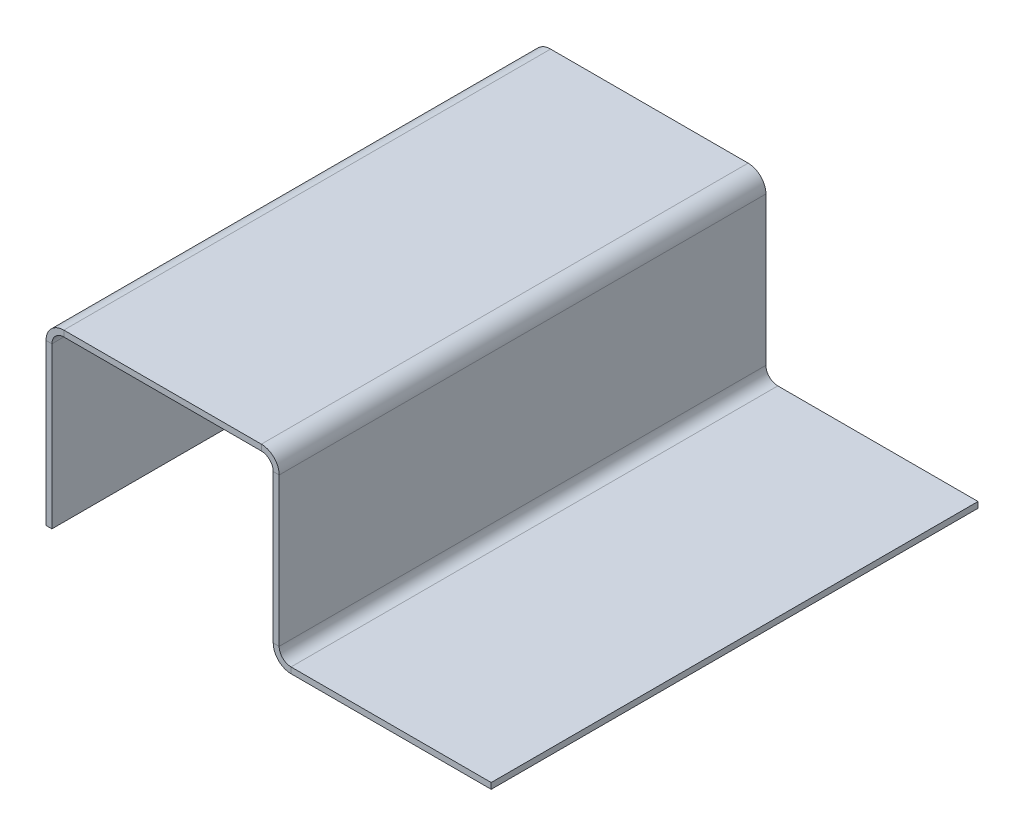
ISO-10303-21;
HEADER;
FILE_DESCRIPTION(('STEP AP214'),'2;1');
FILE_NAME('part.step','',(''),(''),'','','');
FILE_SCHEMA(('AUTOMOTIVE_DESIGN { 1 0 10303 214 1 1 1 1 }'));
ENDSEC;
DATA;
#1=APPLICATION_CONTEXT('core data for automotive mechanical design processes');
#2=APPLICATION_PROTOCOL_DEFINITION('international standard','automotive_design',2000,#1);
#3=PRODUCT_CONTEXT('',#1,'mechanical');
#4=PRODUCT('Part','Part','',(#3));
#5=PRODUCT_RELATED_PRODUCT_CATEGORY('part','',(#4));
#6=PRODUCT_DEFINITION_FORMATION('','',#4);
#7=PRODUCT_DEFINITION_CONTEXT('part definition',#1,'design');
#8=PRODUCT_DEFINITION('design','',#6,#7);
#9=PRODUCT_DEFINITION_SHAPE('','',#8);
#10=(LENGTH_UNIT() NAMED_UNIT(*) SI_UNIT(.MILLI.,.METRE.));
#11=(NAMED_UNIT(*) PLANE_ANGLE_UNIT() SI_UNIT($,.RADIAN.));
#12=(NAMED_UNIT(*) SI_UNIT($,.STERADIAN.) SOLID_ANGLE_UNIT());
#13=UNCERTAINTY_MEASURE_WITH_UNIT(LENGTH_MEASURE(1.E-05),#10,'distance_accuracy_value','');
#14=(GEOMETRIC_REPRESENTATION_CONTEXT(3) GLOBAL_UNCERTAINTY_ASSIGNED_CONTEXT((#13)) GLOBAL_UNIT_ASSIGNED_CONTEXT((#10,
#11,#12)) REPRESENTATION_CONTEXT('',''));
#15=CARTESIAN_POINT('',(0.,0.,0.));
#16=DIRECTION('',(0.,0.,1.));
#17=DIRECTION('',(1.,0.,0.));
#18=AXIS2_PLACEMENT_3D('',#15,#16,#17);
#19=CARTESIAN_POINT('',(172.661518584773,0.,41.));
#20=DIRECTION('',(0.,1.,0.));
#21=DIRECTION('',(-1.,0.,0.));
#22=AXIS2_PLACEMENT_3D('',#19,#20,#21);
#23=PLANE('',#22);
#24=DIRECTION('',(0.,0.,-1.));
#25=VECTOR('',#24,1.);
#26=CARTESIAN_POINT('',(0.,0.,41.));
#27=LINE('',#26,#25);
#28=CARTESIAN_POINT('',(0.,0.,41.));
#29=VERTEX_POINT('',#28);
#30=CARTESIAN_POINT('',(0.,0.,-41.));
#31=VERTEX_POINT('',#30);
#32=EDGE_CURVE('E67',#29,#31,#27,.T.);
#33=ORIENTED_EDGE('',*,*,#32,.T.);
#34=DIRECTION('',(-1.,0.,0.));
#35=VECTOR('',#34,1.);
#36=CARTESIAN_POINT('',(172.661518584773,0.,-41.));
#37=LINE('',#36,#35);
#38=CARTESIAN_POINT('',(1.,0.,-41.));
#39=VERTEX_POINT('',#38);
#40=EDGE_CURVE('E192',#39,#31,#37,.T.);
#41=ORIENTED_EDGE('',*,*,#40,.F.);
#42=DIRECTION('',(0.,0.,-1.));
#43=VECTOR('',#42,1.);
#44=CARTESIAN_POINT('',(1.,0.,41.));
#45=LINE('',#44,#43);
#46=CARTESIAN_POINT('',(0.999999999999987,0.,41.));
#47=VERTEX_POINT('',#46);
#48=EDGE_CURVE('E11',#47,#39,#45,.T.);
#49=ORIENTED_EDGE('',*,*,#48,.F.);
#50=DIRECTION('',(-1.,0.,0.));
#51=VECTOR('',#50,1.);
#52=CARTESIAN_POINT('',(172.661518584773,0.,41.));
#53=LINE('',#52,#51);
#54=EDGE_CURVE('E62',#47,#29,#53,.T.);
#55=ORIENTED_EDGE('',*,*,#54,.T.);
#56=EDGE_LOOP('',(#33,#41,#49,#55));
#57=FACE_BOUND('',#56,.T.);
#58=ADVANCED_FACE('F31',(#57),#23,.F.);
#59=CARTESIAN_POINT('',(172.661518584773,0.,41.));
#60=DIRECTION('',(0.,0.,1.));
#61=DIRECTION('',(0.,1.,0.));
#62=AXIS2_PLACEMENT_3D('',#59,#60,#61);
#63=PLANE('',#62);
#64=DIRECTION('',(-1.,0.,0.));
#65=VECTOR('',#64,1.);
#66=CARTESIAN_POINT('',(172.661518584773,27.,41.));
#67=LINE('',#66,#65);
#68=CARTESIAN_POINT('',(1.00000000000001,27.,41.));
#69=VERTEX_POINT('',#68);
#70=CARTESIAN_POINT('',(0.,27.,41.));
#71=VERTEX_POINT('',#70);
#72=EDGE_CURVE('E154',#69,#71,#67,.T.);
#73=ORIENTED_EDGE('',*,*,#72,.T.);
#74=DIRECTION('',(0.,1.,0.));
#75=VECTOR('',#74,1.);
#76=CARTESIAN_POINT('',(0.,0.,41.));
#77=LINE('',#76,#75);
#78=EDGE_CURVE('E173',#29,#71,#77,.T.);
#79=ORIENTED_EDGE('',*,*,#78,.F.);
#80=ORIENTED_EDGE('',*,*,#54,.F.);
#81=DIRECTION('',(0.,1.,0.));
#82=VECTOR('',#81,1.);
#83=CARTESIAN_POINT('',(1.,0.,41.));
#84=LINE('',#83,#82);
#85=EDGE_CURVE('E163',#47,#69,#84,.T.);
#86=ORIENTED_EDGE('',*,*,#85,.T.);
#87=EDGE_LOOP('',(#73,#79,#80,#86));
#88=FACE_BOUND('',#87,.T.);
#89=ADVANCED_FACE('F172',(#88),#63,.T.);
#90=CARTESIAN_POINT('',(0.,0.,41.));
#91=DIRECTION('',(-1.,0.,0.));
#92=DIRECTION('',(0.,0.,1.));
#93=AXIS2_PLACEMENT_3D('',#90,#91,#92);
#94=PLANE('',#93);
#95=DIRECTION('',(0.,1.,0.));
#96=VECTOR('',#95,1.);
#97=CARTESIAN_POINT('',(0.,0.,-41.));
#98=LINE('',#97,#96);
#99=CARTESIAN_POINT('',(0.,27.,-41.));
#100=VERTEX_POINT('',#99);
#101=EDGE_CURVE('E189',#31,#100,#98,.T.);
#102=ORIENTED_EDGE('',*,*,#101,.F.);
#103=ORIENTED_EDGE('',*,*,#32,.F.);
#104=ORIENTED_EDGE('',*,*,#78,.T.);
#105=DIRECTION('',(0.,0.,-1.));
#106=VECTOR('',#105,1.);
#107=CARTESIAN_POINT('',(0.,27.,41.));
#108=LINE('',#107,#106);
#109=EDGE_CURVE('E175',#71,#100,#108,.T.);
#110=ORIENTED_EDGE('',*,*,#109,.T.);
#111=EDGE_LOOP('',(#102,#103,#104,#110));
#112=FACE_BOUND('',#111,.T.);
#113=ADVANCED_FACE('F195',(#112),#94,.T.);
#114=CARTESIAN_POINT('',(172.661518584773,0.,-41.));
#115=DIRECTION('',(0.,0.,1.));
#116=DIRECTION('',(0.,1.,0.));
#117=AXIS2_PLACEMENT_3D('',#114,#115,#116);
#118=PLANE('',#117);
#119=ORIENTED_EDGE('',*,*,#101,.T.);
#120=DIRECTION('',(-1.,0.,0.));
#121=VECTOR('',#120,1.);
#122=CARTESIAN_POINT('',(172.661518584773,27.,-41.));
#123=LINE('',#122,#121);
#124=CARTESIAN_POINT('',(1.00000000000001,27.,-40.9999999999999));
#125=VERTEX_POINT('',#124);
#126=EDGE_CURVE('E171',#125,#100,#123,.T.);
#127=ORIENTED_EDGE('',*,*,#126,.F.);
#128=DIRECTION('',(0.,1.,0.));
#129=VECTOR('',#128,1.);
#130=CARTESIAN_POINT('',(1.,0.,-41.));
#131=LINE('',#130,#129);
#132=EDGE_CURVE('E41',#39,#125,#131,.T.);
#133=ORIENTED_EDGE('',*,*,#132,.F.);
#134=ORIENTED_EDGE('',*,*,#40,.T.);
#135=EDGE_LOOP('',(#119,#127,#133,#134));
#136=FACE_BOUND('',#135,.T.);
#137=ADVANCED_FACE('F191',(#136),#118,.F.);
#138=CARTESIAN_POINT('',(1.,0.,41.));
#139=DIRECTION('',(-1.,0.,0.));
#140=DIRECTION('',(0.,0.,1.));
#141=AXIS2_PLACEMENT_3D('',#138,#139,#140);
#142=PLANE('',#141);
#143=ORIENTED_EDGE('',*,*,#132,.T.);
#144=DIRECTION('',(0.,0.,-1.));
#145=VECTOR('',#144,1.);
#146=CARTESIAN_POINT('',(1.,27.,41.));
#147=LINE('',#146,#145);
#148=EDGE_CURVE('E35',#69,#125,#147,.T.);
#149=ORIENTED_EDGE('',*,*,#148,.F.);
#150=ORIENTED_EDGE('',*,*,#85,.F.);
#151=ORIENTED_EDGE('',*,*,#48,.T.);
#152=EDGE_LOOP('',(#143,#149,#150,#151));
#153=FACE_BOUND('',#152,.T.);
#154=ADVANCED_FACE('F33',(#153),#142,.F.);
#155=CARTESIAN_POINT('',(3.00000000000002,-146.989651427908,41.));
#156=DIRECTION('',(0.,0.,1.));
#157=DIRECTION('',(1.,0.,0.));
#158=AXIS2_PLACEMENT_3D('',#155,#156,#157);
#159=PLANE('',#158);
#160=DIRECTION('',(0.,1.,0.));
#161=VECTOR('',#160,1.);
#162=CARTESIAN_POINT('',(36.2766311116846,-146.989651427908,41.));
#163=LINE('',#162,#161);
#164=CARTESIAN_POINT('',(36.2766311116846,29.,41.));
#165=VERTEX_POINT('',#164);
#166=CARTESIAN_POINT('',(36.2766311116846,30.,41.));
#167=VERTEX_POINT('',#166);
#168=EDGE_CURVE('E211',#165,#167,#163,.T.);
#169=ORIENTED_EDGE('',*,*,#168,.T.);
#170=DIRECTION('',(1.,0.,0.));
#171=VECTOR('',#170,1.);
#172=CARTESIAN_POINT('',(2.99999999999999,30.,41.));
#173=LINE('',#172,#171);
#174=CARTESIAN_POINT('',(3.,30.,41.));
#175=VERTEX_POINT('',#174);
#176=EDGE_CURVE('E217',#175,#167,#173,.T.);
#177=ORIENTED_EDGE('',*,*,#176,.F.);
#178=DIRECTION('',(0.,1.,0.));
#179=VECTOR('',#178,1.);
#180=CARTESIAN_POINT('',(3.00000000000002,-146.989651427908,41.));
#181=LINE('',#180,#179);
#182=CARTESIAN_POINT('',(3.,29.,41.));
#183=VERTEX_POINT('',#182);
#184=EDGE_CURVE('E209',#183,#175,#181,.T.);
#185=ORIENTED_EDGE('',*,*,#184,.F.);
#186=DIRECTION('',(1.,0.,0.));
#187=VECTOR('',#186,1.);
#188=CARTESIAN_POINT('',(2.99999999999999,29.,41.));
#189=LINE('',#188,#187);
#190=EDGE_CURVE('E214',#183,#165,#189,.T.);
#191=ORIENTED_EDGE('',*,*,#190,.T.);
#192=EDGE_LOOP('',(#169,#177,#185,#191));
#193=FACE_BOUND('',#192,.T.);
#194=ADVANCED_FACE('F331',(#193),#159,.T.);
#195=CARTESIAN_POINT('',(2.99999999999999,30.,41.));
#196=DIRECTION('',(0.,1.,0.));
#197=DIRECTION('',(-1.,0.,0.));
#198=AXIS2_PLACEMENT_3D('',#195,#196,#197);
#199=PLANE('',#198);
#200=DIRECTION('',(1.,0.,0.));
#201=VECTOR('',#200,1.);
#202=CARTESIAN_POINT('',(2.99999999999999,30.,-41.));
#203=LINE('',#202,#201);
#204=CARTESIAN_POINT('',(2.99999999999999,30.,-41.));
#205=VERTEX_POINT('',#204);
#206=CARTESIAN_POINT('',(36.2766311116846,30.,-41.));
#207=VERTEX_POINT('',#206);
#208=EDGE_CURVE('E223',#205,#207,#203,.T.);
#209=ORIENTED_EDGE('',*,*,#208,.F.);
#210=DIRECTION('',(0.,0.,-1.));
#211=VECTOR('',#210,1.);
#212=CARTESIAN_POINT('',(2.99999999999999,30.,41.));
#213=LINE('',#212,#211);
#214=EDGE_CURVE('E207',#175,#205,#213,.T.);
#215=ORIENTED_EDGE('',*,*,#214,.F.);
#216=ORIENTED_EDGE('',*,*,#176,.T.);
#217=DIRECTION('',(0.,0.,-1.));
#218=VECTOR('',#217,1.);
#219=CARTESIAN_POINT('',(36.2766311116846,30.,41.));
#220=LINE('',#219,#218);
#221=EDGE_CURVE('E220',#167,#207,#220,.T.);
#222=ORIENTED_EDGE('',*,*,#221,.T.);
#223=EDGE_LOOP('',(#209,#215,#216,#222));
#224=FACE_BOUND('',#223,.T.);
#225=ADVANCED_FACE('F328',(#224),#199,.T.);
#226=CARTESIAN_POINT('',(3.00000000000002,-146.989651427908,-41.));
#227=DIRECTION('',(0.,0.,1.));
#228=DIRECTION('',(1.,0.,0.));
#229=AXIS2_PLACEMENT_3D('',#226,#227,#228);
#230=PLANE('',#229);
#231=ORIENTED_EDGE('',*,*,#208,.T.);
#232=DIRECTION('',(0.,1.,0.));
#233=VECTOR('',#232,1.);
#234=CARTESIAN_POINT('',(36.2766311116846,-146.989651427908,-41.));
#235=LINE('',#234,#233);
#236=CARTESIAN_POINT('',(36.2766311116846,29.,-40.9999999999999));
#237=VERTEX_POINT('',#236);
#238=EDGE_CURVE('E203',#237,#207,#235,.T.);
#239=ORIENTED_EDGE('',*,*,#238,.F.);
#240=DIRECTION('',(1.,0.,0.));
#241=VECTOR('',#240,1.);
#242=CARTESIAN_POINT('',(2.99999999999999,29.,-41.));
#243=LINE('',#242,#241);
#244=CARTESIAN_POINT('',(2.99999999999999,29.,-41.));
#245=VERTEX_POINT('',#244);
#246=EDGE_CURVE('E229',#245,#237,#243,.T.);
#247=ORIENTED_EDGE('',*,*,#246,.F.);
#248=DIRECTION('',(0.,1.,0.));
#249=VECTOR('',#248,1.);
#250=CARTESIAN_POINT('',(3.00000000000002,-146.989651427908,-41.));
#251=LINE('',#250,#249);
#252=EDGE_CURVE('E226',#245,#205,#251,.T.);
#253=ORIENTED_EDGE('',*,*,#252,.T.);
#254=EDGE_LOOP('',(#231,#239,#247,#253));
#255=FACE_BOUND('',#254,.T.);
#256=ADVANCED_FACE('F345',(#255),#230,.F.);
#257=CARTESIAN_POINT('',(2.99999999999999,29.,41.));
#258=DIRECTION('',(0.,1.,0.));
#259=DIRECTION('',(-1.,0.,0.));
#260=AXIS2_PLACEMENT_3D('',#257,#258,#259);
#261=PLANE('',#260);
#262=ORIENTED_EDGE('',*,*,#246,.T.);
#263=DIRECTION('',(0.,0.,-1.));
#264=VECTOR('',#263,1.);
#265=CARTESIAN_POINT('',(36.2766311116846,29.,41.));
#266=LINE('',#265,#264);
#267=EDGE_CURVE('E200',#165,#237,#266,.T.);
#268=ORIENTED_EDGE('',*,*,#267,.F.);
#269=ORIENTED_EDGE('',*,*,#190,.F.);
#270=DIRECTION('',(0.,0.,-1.));
#271=VECTOR('',#270,1.);
#272=CARTESIAN_POINT('',(2.99999999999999,29.,41.));
#273=LINE('',#272,#271);
#274=EDGE_CURVE('E168',#183,#245,#273,.T.);
#275=ORIENTED_EDGE('',*,*,#274,.T.);
#276=EDGE_LOOP('',(#262,#268,#269,#275));
#277=FACE_BOUND('',#276,.T.);
#278=ADVANCED_FACE('F342',(#277),#261,.F.);
#279=CARTESIAN_POINT('',(38.2766311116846,27.,41.));
#280=DIRECTION('',(1.,0.,0.));
#281=DIRECTION('',(0.,1.,0.));
#282=AXIS2_PLACEMENT_3D('',#279,#280,#281);
#283=PLANE('',#282);
#284=DIRECTION('',(0.,-1.,0.));
#285=VECTOR('',#284,1.);
#286=CARTESIAN_POINT('',(38.2766311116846,27.,-41.));
#287=LINE('',#286,#285);
#288=CARTESIAN_POINT('',(38.2766311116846,27.,-40.9999999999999));
#289=VERTEX_POINT('',#288);
#290=CARTESIAN_POINT('',(38.2766311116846,1.99999999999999,-41.));
#291=VERTEX_POINT('',#290);
#292=EDGE_CURVE('E261',#289,#291,#287,.T.);
#293=ORIENTED_EDGE('',*,*,#292,.T.);
#294=DIRECTION('',(0.,0.,-1.));
#295=VECTOR('',#294,1.);
#296=CARTESIAN_POINT('',(38.2766311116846,1.99999999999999,41.));
#297=LINE('',#296,#295);
#298=CARTESIAN_POINT('',(38.2766311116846,1.99999999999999,41.));
#299=VERTEX_POINT('',#298);
#300=EDGE_CURVE('E258',#299,#291,#297,.T.);
#301=ORIENTED_EDGE('',*,*,#300,.F.);
#302=DIRECTION('',(0.,-1.,0.));
#303=VECTOR('',#302,1.);
#304=CARTESIAN_POINT('',(38.2766311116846,27.,41.));
#305=LINE('',#304,#303);
#306=CARTESIAN_POINT('',(38.2766311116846,27.,41.));
#307=VERTEX_POINT('',#306);
#308=EDGE_CURVE('E255',#307,#299,#305,.T.);
#309=ORIENTED_EDGE('',*,*,#308,.F.);
#310=DIRECTION('',(0.,0.,-1.));
#311=VECTOR('',#310,1.);
#312=CARTESIAN_POINT('',(38.2766311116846,27.,41.));
#313=LINE('',#312,#311);
#314=EDGE_CURVE('E252',#307,#289,#313,.T.);
#315=ORIENTED_EDGE('',*,*,#314,.T.);
#316=EDGE_LOOP('',(#293,#301,#309,#315));
#317=FACE_BOUND('',#316,.T.);
#318=ADVANCED_FACE('F355',(#317),#283,.F.);
#319=CARTESIAN_POINT('',(210.729248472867,26.9999999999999,-41.));
#320=DIRECTION('',(0.,0.,-1.));
#321=DIRECTION('',(0.,1.,0.));
#322=AXIS2_PLACEMENT_3D('',#319,#320,#321);
#323=PLANE('',#322);
#324=ORIENTED_EDGE('',*,*,#292,.F.);
#325=DIRECTION('',(-1.,0.,0.));
#326=VECTOR('',#325,1.);
#327=CARTESIAN_POINT('',(210.729248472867,26.9999999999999,-41.));
#328=LINE('',#327,#326);
#329=CARTESIAN_POINT('',(39.2766311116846,27.,-41.));
#330=VERTEX_POINT('',#329);
#331=EDGE_CURVE('E204',#330,#289,#328,.T.);
#332=ORIENTED_EDGE('',*,*,#331,.F.);
#333=DIRECTION('',(0.,-1.,0.));
#334=VECTOR('',#333,1.);
#335=CARTESIAN_POINT('',(39.2766311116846,27.,-41.));
#336=LINE('',#335,#334);
#337=CARTESIAN_POINT('',(39.2766311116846,1.99999999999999,-41.));
#338=VERTEX_POINT('',#337);
#339=EDGE_CURVE('E250',#330,#338,#336,.T.);
#340=ORIENTED_EDGE('',*,*,#339,.T.);
#341=DIRECTION('',(-1.,0.,0.));
#342=VECTOR('',#341,1.);
#343=CARTESIAN_POINT('',(210.729248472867,1.99999999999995,-41.));
#344=LINE('',#343,#342);
#345=EDGE_CURVE('E240',#338,#291,#344,.T.);
#346=ORIENTED_EDGE('',*,*,#345,.T.);
#347=EDGE_LOOP('',(#324,#332,#340,#346));
#348=FACE_BOUND('',#347,.T.);
#349=ADVANCED_FACE('F351',(#348),#323,.T.);
#350=CARTESIAN_POINT('',(210.729248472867,26.9999999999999,41.));
#351=DIRECTION('',(0.,0.,-1.));
#352=DIRECTION('',(0.,1.,0.));
#353=AXIS2_PLACEMENT_3D('',#350,#351,#352);
#354=PLANE('',#353);
#355=DIRECTION('',(-1.,0.,0.));
#356=VECTOR('',#355,1.);
#357=CARTESIAN_POINT('',(210.729248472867,26.9999999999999,41.));
#358=LINE('',#357,#356);
#359=CARTESIAN_POINT('',(39.2766311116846,27.,41.));
#360=VERTEX_POINT('',#359);
#361=EDGE_CURVE('E234',#360,#307,#358,.T.);
#362=ORIENTED_EDGE('',*,*,#361,.T.);
#363=ORIENTED_EDGE('',*,*,#308,.T.);
#364=DIRECTION('',(-1.,0.,0.));
#365=VECTOR('',#364,1.);
#366=CARTESIAN_POINT('',(210.729248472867,1.99999999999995,41.));
#367=LINE('',#366,#365);
#368=CARTESIAN_POINT('',(39.2766311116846,1.99999999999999,41.));
#369=VERTEX_POINT('',#368);
#370=EDGE_CURVE('E237',#369,#299,#367,.T.);
#371=ORIENTED_EDGE('',*,*,#370,.F.);
#372=DIRECTION('',(0.,-1.,0.));
#373=VECTOR('',#372,1.);
#374=CARTESIAN_POINT('',(39.2766311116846,27.,41.));
#375=LINE('',#374,#373);
#376=EDGE_CURVE('E245',#360,#369,#375,.T.);
#377=ORIENTED_EDGE('',*,*,#376,.F.);
#378=EDGE_LOOP('',(#362,#363,#371,#377));
#379=FACE_BOUND('',#378,.T.);
#380=ADVANCED_FACE('F358',(#379),#354,.F.);
#381=CARTESIAN_POINT('',(39.2766311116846,27.,41.));
#382=DIRECTION('',(1.,0.,0.));
#383=DIRECTION('',(0.,1.,0.));
#384=AXIS2_PLACEMENT_3D('',#381,#382,#383);
#385=PLANE('',#384);
#386=ORIENTED_EDGE('',*,*,#339,.F.);
#387=DIRECTION('',(0.,0.,-1.));
#388=VECTOR('',#387,1.);
#389=CARTESIAN_POINT('',(39.2766311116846,27.,41.));
#390=LINE('',#389,#388);
#391=EDGE_CURVE('E248',#360,#330,#390,.T.);
#392=ORIENTED_EDGE('',*,*,#391,.F.);
#393=ORIENTED_EDGE('',*,*,#376,.T.);
#394=DIRECTION('',(0.,0.,-1.));
#395=VECTOR('',#394,1.);
#396=CARTESIAN_POINT('',(39.2766311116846,1.99999999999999,41.));
#397=LINE('',#396,#395);
#398=EDGE_CURVE('E242',#369,#338,#397,.T.);
#399=ORIENTED_EDGE('',*,*,#398,.T.);
#400=EDGE_LOOP('',(#386,#392,#393,#399));
#401=FACE_BOUND('',#400,.T.);
#402=ADVANCED_FACE('F363',(#401),#385,.T.);
#403=CARTESIAN_POINT('',(75.,177.327556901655,41.));
#404=DIRECTION('',(-1.,0.,0.));
#405=DIRECTION('',(0.,0.,1.));
#406=AXIS2_PLACEMENT_3D('',#403,#404,#405);
#407=PLANE('',#406);
#408=DIRECTION('',(0.,-1.,0.));
#409=VECTOR('',#408,1.);
#410=CARTESIAN_POINT('',(75.,177.327556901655,41.));
#411=LINE('',#410,#409);
#412=CARTESIAN_POINT('',(75.,0.,41.));
#413=VERTEX_POINT('',#412);
#414=CARTESIAN_POINT('',(75.,-1.,41.));
#415=VERTEX_POINT('',#414);
#416=EDGE_CURVE('E271',#413,#415,#411,.T.);
#417=ORIENTED_EDGE('',*,*,#416,.T.);
#418=DIRECTION('',(0.,0.,-1.));
#419=VECTOR('',#418,1.);
#420=CARTESIAN_POINT('',(75.,-1.,41.));
#421=LINE('',#420,#419);
#422=CARTESIAN_POINT('',(75.,-1.,-41.));
#423=VERTEX_POINT('',#422);
#424=EDGE_CURVE('E274',#415,#423,#421,.T.);
#425=ORIENTED_EDGE('',*,*,#424,.T.);
#426=DIRECTION('',(0.,-1.,0.));
#427=VECTOR('',#426,1.);
#428=CARTESIAN_POINT('',(75.,177.327556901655,-41.));
#429=LINE('',#428,#427);
#430=CARTESIAN_POINT('',(75.,0.,-41.));
#431=VERTEX_POINT('',#430);
#432=EDGE_CURVE('E264',#431,#423,#429,.T.);
#433=ORIENTED_EDGE('',*,*,#432,.F.);
#434=DIRECTION('',(0.,0.,-1.));
#435=VECTOR('',#434,1.);
#436=CARTESIAN_POINT('',(75.,0.,41.));
#437=LINE('',#436,#435);
#438=EDGE_CURVE('E280',#413,#431,#437,.T.);
#439=ORIENTED_EDGE('',*,*,#438,.F.);
#440=EDGE_LOOP('',(#417,#425,#433,#439));
#441=FACE_BOUND('',#440,.T.);
#442=ADVANCED_FACE('F383',(#441),#407,.F.);
#443=CARTESIAN_POINT('',(41.2766311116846,0.,41.));
#444=DIRECTION('',(0.,1.,0.));
#445=DIRECTION('',(0.,0.,1.));
#446=AXIS2_PLACEMENT_3D('',#443,#444,#445);
#447=PLANE('',#446);
#448=DIRECTION('',(1.,0.,0.));
#449=VECTOR('',#448,1.);
#450=CARTESIAN_POINT('',(41.2766311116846,0.,-41.));
#451=LINE('',#450,#449);
#452=CARTESIAN_POINT('',(41.2766311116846,0.,-41.));
#453=VERTEX_POINT('',#452);
#454=EDGE_CURVE('E294',#453,#431,#451,.T.);
#455=ORIENTED_EDGE('',*,*,#454,.F.);
#456=DIRECTION('',(0.,0.,-1.));
#457=VECTOR('',#456,1.);
#458=CARTESIAN_POINT('',(41.2766311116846,0.,41.));
#459=LINE('',#458,#457);
#460=CARTESIAN_POINT('',(41.2766311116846,0.,40.9999999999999));
#461=VERTEX_POINT('',#460);
#462=EDGE_CURVE('E265',#461,#453,#459,.T.);
#463=ORIENTED_EDGE('',*,*,#462,.F.);
#464=DIRECTION('',(1.,0.,0.));
#465=VECTOR('',#464,1.);
#466=CARTESIAN_POINT('',(41.2766311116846,0.,41.));
#467=LINE('',#466,#465);
#468=EDGE_CURVE('E277',#461,#413,#467,.T.);
#469=ORIENTED_EDGE('',*,*,#468,.T.);
#470=ORIENTED_EDGE('',*,*,#438,.T.);
#471=EDGE_LOOP('',(#455,#463,#469,#470));
#472=FACE_BOUND('',#471,.T.);
#473=ADVANCED_FACE('F380',(#472),#447,.T.);
#474=CARTESIAN_POINT('',(41.2766311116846,177.327556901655,41.));
#475=DIRECTION('',(0.,0.,-1.));
#476=DIRECTION('',(-1.,0.,0.));
#477=AXIS2_PLACEMENT_3D('',#474,#475,#476);
#478=PLANE('',#477);
#479=DIRECTION('',(0.,-1.,0.));
#480=VECTOR('',#479,1.);
#481=CARTESIAN_POINT('',(41.2766311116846,177.327556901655,41.));
#482=LINE('',#481,#480);
#483=CARTESIAN_POINT('',(41.2766311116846,-1.,41.));
#484=VERTEX_POINT('',#483);
#485=EDGE_CURVE('E283',#461,#484,#482,.T.);
#486=ORIENTED_EDGE('',*,*,#485,.T.);
#487=DIRECTION('',(1.,0.,0.));
#488=VECTOR('',#487,1.);
#489=CARTESIAN_POINT('',(41.2766311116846,-1.,41.));
#490=LINE('',#489,#488);
#491=EDGE_CURVE('E286',#484,#415,#490,.T.);
#492=ORIENTED_EDGE('',*,*,#491,.T.);
#493=ORIENTED_EDGE('',*,*,#416,.F.);
#494=ORIENTED_EDGE('',*,*,#468,.F.);
#495=EDGE_LOOP('',(#486,#492,#493,#494));
#496=FACE_BOUND('',#495,.T.);
#497=ADVANCED_FACE('F385',(#496),#478,.F.);
#498=CARTESIAN_POINT('',(41.2766311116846,-1.,41.));
#499=DIRECTION('',(0.,1.,0.));
#500=DIRECTION('',(0.,0.,1.));
#501=AXIS2_PLACEMENT_3D('',#498,#499,#500);
#502=PLANE('',#501);
#503=DIRECTION('',(1.,0.,0.));
#504=VECTOR('',#503,1.);
#505=CARTESIAN_POINT('',(41.2766311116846,-1.,-41.));
#506=LINE('',#505,#504);
#507=CARTESIAN_POINT('',(41.2766311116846,-1.,-41.));
#508=VERTEX_POINT('',#507);
#509=EDGE_CURVE('E289',#508,#423,#506,.T.);
#510=ORIENTED_EDGE('',*,*,#509,.T.);
#511=ORIENTED_EDGE('',*,*,#424,.F.);
#512=ORIENTED_EDGE('',*,*,#491,.F.);
#513=DIRECTION('',(0.,0.,-1.));
#514=VECTOR('',#513,1.);
#515=CARTESIAN_POINT('',(41.2766311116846,-1.,41.));
#516=LINE('',#515,#514);
#517=EDGE_CURVE('E291',#484,#508,#516,.T.);
#518=ORIENTED_EDGE('',*,*,#517,.T.);
#519=EDGE_LOOP('',(#510,#511,#512,#518));
#520=FACE_BOUND('',#519,.T.);
#521=ADVANCED_FACE('F388',(#520),#502,.F.);
#522=CARTESIAN_POINT('',(41.2766311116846,177.327556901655,-41.));
#523=DIRECTION('',(0.,0.,-1.));
#524=DIRECTION('',(-1.,0.,0.));
#525=AXIS2_PLACEMENT_3D('',#522,#523,#524);
#526=PLANE('',#525);
#527=ORIENTED_EDGE('',*,*,#509,.F.);
#528=DIRECTION('',(0.,-1.,0.));
#529=VECTOR('',#528,1.);
#530=CARTESIAN_POINT('',(41.2766311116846,177.327556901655,-41.));
#531=LINE('',#530,#529);
#532=EDGE_CURVE('E268',#453,#508,#531,.T.);
#533=ORIENTED_EDGE('',*,*,#532,.F.);
#534=ORIENTED_EDGE('',*,*,#454,.T.);
#535=ORIENTED_EDGE('',*,*,#432,.T.);
#536=EDGE_LOOP('',(#527,#533,#534,#535));
#537=FACE_BOUND('',#536,.T.);
#538=ADVANCED_FACE('F379',(#537),#526,.T.);
#539=CARTESIAN_POINT('',(41.2766311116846,2.,-41.));
#540=DIRECTION('',(0.,0.,-1.));
#541=DIRECTION('',(-1.,0.,0.));
#542=AXIS2_PLACEMENT_3D('',#539,#540,#541);
#543=PLANE('',#542);
#544=ORIENTED_EDGE('',*,*,#345,.F.);
#545=CARTESIAN_POINT('',(41.2766311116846,2.,-41.));
#546=DIRECTION('',(0.,0.,1.));
#547=DIRECTION('',(1.,0.,0.));
#548=AXIS2_PLACEMENT_3D('',#545,#546,#547);
#549=CIRCLE('',#548,2.);
#550=EDGE_CURVE('E307',#338,#453,#549,.T.);
#551=ORIENTED_EDGE('',*,*,#550,.T.);
#552=ORIENTED_EDGE('',*,*,#532,.T.);
#553=CARTESIAN_POINT('',(41.2766311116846,2.,-41.));
#554=DIRECTION('',(0.,0.,1.));
#555=DIRECTION('',(1.,0.,0.));
#556=AXIS2_PLACEMENT_3D('',#553,#554,#555);
#557=CIRCLE('',#556,3.);
#558=EDGE_CURVE('E301',#291,#508,#557,.T.);
#559=ORIENTED_EDGE('',*,*,#558,.F.);
#560=EDGE_LOOP('',(#544,#551,#552,#559));
#561=FACE_BOUND('',#560,.T.);
#562=ADVANCED_FACE('F370',(#561),#543,.T.);
#563=CARTESIAN_POINT('',(41.2766311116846,2.,41.));
#564=DIRECTION('',(0.,0.,1.));
#565=DIRECTION('',(1.,0.,0.));
#566=AXIS2_PLACEMENT_3D('',#563,#564,#565);
#567=PLANE('',#566);
#568=CARTESIAN_POINT('',(41.2766311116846,2.,40.9999999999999));
#569=DIRECTION('',(0.,0.,1.));
#570=DIRECTION('',(1.,0.,0.));
#571=AXIS2_PLACEMENT_3D('',#568,#569,#570);
#572=CIRCLE('',#571,2.);
#573=EDGE_CURVE('E304',#461,#369,#572,.F.);
#574=ORIENTED_EDGE('',*,*,#573,.T.);
#575=ORIENTED_EDGE('',*,*,#370,.T.);
#576=CARTESIAN_POINT('',(41.2766311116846,2.,41.));
#577=DIRECTION('',(0.,0.,-1.));
#578=DIRECTION('',(-1.,0.,0.));
#579=AXIS2_PLACEMENT_3D('',#576,#577,#578);
#580=CIRCLE('',#579,3.);
#581=EDGE_CURVE('E269',#484,#299,#580,.T.);
#582=ORIENTED_EDGE('',*,*,#581,.F.);
#583=ORIENTED_EDGE('',*,*,#485,.F.);
#584=EDGE_LOOP('',(#574,#575,#582,#583));
#585=FACE_BOUND('',#584,.T.);
#586=ADVANCED_FACE('F393',(#585),#567,.T.);
#587=CARTESIAN_POINT('',(41.2766311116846,2.,-197.366573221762));
#588=DIRECTION('',(0.,0.,1.));
#589=DIRECTION('',(1.,0.,0.));
#590=AXIS2_PLACEMENT_3D('',#587,#588,#589);
#591=CYLINDRICAL_SURFACE('',#590,3.);
#592=ORIENTED_EDGE('',*,*,#517,.F.);
#593=ORIENTED_EDGE('',*,*,#581,.T.);
#594=ORIENTED_EDGE('',*,*,#300,.T.);
#595=ORIENTED_EDGE('',*,*,#558,.T.);
#596=EDGE_LOOP('',(#592,#593,#594,#595));
#597=FACE_BOUND('',#596,.T.);
#598=ADVANCED_FACE('F391',(#597),#591,.T.);
#599=CARTESIAN_POINT('',(41.2766311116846,2.,-197.366573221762));
#600=DIRECTION('',(0.,0.,1.));
#601=DIRECTION('',(1.,0.,0.));
#602=AXIS2_PLACEMENT_3D('',#599,#600,#601);
#603=CYLINDRICAL_SURFACE('',#602,2.);
#604=ORIENTED_EDGE('',*,*,#462,.T.);
#605=ORIENTED_EDGE('',*,*,#550,.F.);
#606=ORIENTED_EDGE('',*,*,#398,.F.);
#607=ORIENTED_EDGE('',*,*,#573,.F.);
#608=EDGE_LOOP('',(#604,#605,#606,#607));
#609=FACE_BOUND('',#608,.T.);
#610=ADVANCED_FACE('F371',(#609),#603,.F.);
#611=CARTESIAN_POINT('',(36.2766311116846,27.,-41.));
#612=DIRECTION('',(0.,0.,1.));
#613=DIRECTION('',(1.,0.,0.));
#614=AXIS2_PLACEMENT_3D('',#611,#612,#613);
#615=PLANE('',#614);
#616=ORIENTED_EDGE('',*,*,#331,.T.);
#617=CARTESIAN_POINT('',(36.2766311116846,27.,-40.9999999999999));
#618=DIRECTION('',(0.,0.,-1.));
#619=DIRECTION('',(-1.,0.,0.));
#620=AXIS2_PLACEMENT_3D('',#617,#618,#619);
#621=CIRCLE('',#620,2.00000000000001);
#622=EDGE_CURVE('E318',#237,#289,#621,.T.);
#623=ORIENTED_EDGE('',*,*,#622,.F.);
#624=ORIENTED_EDGE('',*,*,#238,.T.);
#625=CARTESIAN_POINT('',(36.2766311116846,27.,-41.));
#626=DIRECTION('',(0.,0.,-1.));
#627=DIRECTION('',(-1.,0.,0.));
#628=AXIS2_PLACEMENT_3D('',#625,#626,#627);
#629=CIRCLE('',#628,3.);
#630=EDGE_CURVE('E312',#207,#330,#629,.T.);
#631=ORIENTED_EDGE('',*,*,#630,.T.);
#632=EDGE_LOOP('',(#616,#623,#624,#631));
#633=FACE_BOUND('',#632,.T.);
#634=ADVANCED_FACE('F347',(#633),#615,.F.);
#635=CARTESIAN_POINT('',(36.2766311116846,27.,41.));
#636=DIRECTION('',(0.,0.,-1.));
#637=DIRECTION('',(-1.,0.,0.));
#638=AXIS2_PLACEMENT_3D('',#635,#636,#637);
#639=PLANE('',#638);
#640=CARTESIAN_POINT('',(36.2766311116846,27.,41.));
#641=DIRECTION('',(0.,0.,-1.));
#642=DIRECTION('',(-1.,0.,0.));
#643=AXIS2_PLACEMENT_3D('',#640,#641,#642);
#644=CIRCLE('',#643,2.00000000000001);
#645=EDGE_CURVE('E315',#307,#165,#644,.F.);
#646=ORIENTED_EDGE('',*,*,#645,.F.);
#647=ORIENTED_EDGE('',*,*,#361,.F.);
#648=CARTESIAN_POINT('',(36.2766311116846,27.,41.));
#649=DIRECTION('',(0.,0.,1.));
#650=DIRECTION('',(1.,0.,0.));
#651=AXIS2_PLACEMENT_3D('',#648,#649,#650);
#652=CIRCLE('',#651,3.);
#653=EDGE_CURVE('E309',#360,#167,#652,.T.);
#654=ORIENTED_EDGE('',*,*,#653,.T.);
#655=ORIENTED_EDGE('',*,*,#168,.F.);
#656=EDGE_LOOP('',(#646,#647,#654,#655));
#657=FACE_BOUND('',#656,.T.);
#658=ADVANCED_FACE('F333',(#657),#639,.F.);
#659=CARTESIAN_POINT('',(36.2766311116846,27.,173.73345907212));
#660=DIRECTION('',(0.,0.,-1.));
#661=DIRECTION('',(-1.,0.,0.));
#662=AXIS2_PLACEMENT_3D('',#659,#660,#661);
#663=CYLINDRICAL_SURFACE('',#662,3.00000000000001);
#664=ORIENTED_EDGE('',*,*,#221,.F.);
#665=ORIENTED_EDGE('',*,*,#653,.F.);
#666=ORIENTED_EDGE('',*,*,#391,.T.);
#667=ORIENTED_EDGE('',*,*,#630,.F.);
#668=EDGE_LOOP('',(#664,#665,#666,#667));
#669=FACE_BOUND('',#668,.T.);
#670=ADVANCED_FACE('F361',(#669),#663,.T.);
#671=CARTESIAN_POINT('',(36.2766311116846,27.,173.73345907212));
#672=DIRECTION('',(0.,0.,-1.));
#673=DIRECTION('',(-1.,0.,0.));
#674=AXIS2_PLACEMENT_3D('',#671,#672,#673);
#675=CYLINDRICAL_SURFACE('',#674,2.00000000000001);
#676=ORIENTED_EDGE('',*,*,#267,.T.);
#677=ORIENTED_EDGE('',*,*,#622,.T.);
#678=ORIENTED_EDGE('',*,*,#314,.F.);
#679=ORIENTED_EDGE('',*,*,#645,.T.);
#680=EDGE_LOOP('',(#676,#677,#678,#679));
#681=FACE_BOUND('',#680,.T.);
#682=ADVANCED_FACE('F338',(#681),#675,.F.);
#683=CARTESIAN_POINT('',(3.,27.,-41.));
#684=DIRECTION('',(0.,0.,-1.));
#685=DIRECTION('',(-1.,0.,0.));
#686=AXIS2_PLACEMENT_3D('',#683,#684,#685);
#687=PLANE('',#686);
#688=ORIENTED_EDGE('',*,*,#252,.F.);
#689=CARTESIAN_POINT('',(3.,27.,-40.9999999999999));
#690=DIRECTION('',(0.,0.,-1.));
#691=DIRECTION('',(-1.,0.,0.));
#692=AXIS2_PLACEMENT_3D('',#689,#690,#691);
#693=CIRCLE('',#692,2.);
#694=EDGE_CURVE('E74',#245,#125,#693,.F.);
#695=ORIENTED_EDGE('',*,*,#694,.T.);
#696=ORIENTED_EDGE('',*,*,#126,.T.);
#697=CARTESIAN_POINT('',(3.,27.,-41.));
#698=DIRECTION('',(0.,0.,1.));
#699=DIRECTION('',(1.,0.,0.));
#700=AXIS2_PLACEMENT_3D('',#697,#698,#699);
#701=CIRCLE('',#700,3.);
#702=EDGE_CURVE('E185',#205,#100,#701,.T.);
#703=ORIENTED_EDGE('',*,*,#702,.F.);
#704=EDGE_LOOP('',(#688,#695,#696,#703));
#705=FACE_BOUND('',#704,.T.);
#706=ADVANCED_FACE('F184',(#705),#687,.T.);
#707=CARTESIAN_POINT('',(3.,27.,41.));
#708=DIRECTION('',(0.,0.,1.));
#709=DIRECTION('',(1.,0.,0.));
#710=AXIS2_PLACEMENT_3D('',#707,#708,#709);
#711=PLANE('',#710);
#712=ORIENTED_EDGE('',*,*,#72,.F.);
#713=CARTESIAN_POINT('',(3.,27.,41.));
#714=DIRECTION('',(0.,0.,-1.));
#715=DIRECTION('',(-1.,0.,0.));
#716=AXIS2_PLACEMENT_3D('',#713,#714,#715);
#717=CIRCLE('',#716,2.);
#718=EDGE_CURVE('E157',#69,#183,#717,.T.);
#719=ORIENTED_EDGE('',*,*,#718,.T.);
#720=ORIENTED_EDGE('',*,*,#184,.T.);
#721=CARTESIAN_POINT('',(3.,27.,41.));
#722=DIRECTION('',(0.,0.,-1.));
#723=DIRECTION('',(-1.,0.,0.));
#724=AXIS2_PLACEMENT_3D('',#721,#722,#723);
#725=CIRCLE('',#724,3.);
#726=EDGE_CURVE('E159',#71,#175,#725,.T.);
#727=ORIENTED_EDGE('',*,*,#726,.F.);
#728=EDGE_LOOP('',(#712,#719,#720,#727));
#729=FACE_BOUND('',#728,.T.);
#730=ADVANCED_FACE('F156',(#729),#711,.T.);
#731=CARTESIAN_POINT('',(3.,27.,176.798599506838));
#732=DIRECTION('',(0.,0.,-1.));
#733=DIRECTION('',(-1.,0.,0.));
#734=AXIS2_PLACEMENT_3D('',#731,#732,#733);
#735=CYLINDRICAL_SURFACE('',#734,3.);
#736=ORIENTED_EDGE('',*,*,#726,.T.);
#737=ORIENTED_EDGE('',*,*,#214,.T.);
#738=ORIENTED_EDGE('',*,*,#702,.T.);
#739=ORIENTED_EDGE('',*,*,#109,.F.);
#740=EDGE_LOOP('',(#736,#737,#738,#739));
#741=FACE_BOUND('',#740,.T.);
#742=ADVANCED_FACE('F324',(#741),#735,.T.);
#743=CARTESIAN_POINT('',(3.,27.,176.798599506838));
#744=DIRECTION('',(0.,0.,-1.));
#745=DIRECTION('',(-1.,0.,0.));
#746=AXIS2_PLACEMENT_3D('',#743,#744,#745);
#747=CYLINDRICAL_SURFACE('',#746,2.);
#748=ORIENTED_EDGE('',*,*,#718,.F.);
#749=ORIENTED_EDGE('',*,*,#148,.T.);
#750=ORIENTED_EDGE('',*,*,#694,.F.);
#751=ORIENTED_EDGE('',*,*,#274,.F.);
#752=EDGE_LOOP('',(#748,#749,#750,#751));
#753=FACE_BOUND('',#752,.T.);
#754=ADVANCED_FACE('F166',(#753),#747,.F.);
#755=CLOSED_SHELL('',(#58,#89,#113,#137,#154,#194,#225,#256,#278,#318,#349,#380,#402,#442,#473,
#497,#521,#538,#562,#586,#598,#610,#634,#658,#670,#682,#706,#730,#742,#754));
#756=MANIFOLD_SOLID_BREP('B2',#755);
#757=ADVANCED_BREP_SHAPE_REPRESENTATION('',(#18,#756),#14);
#758=SHAPE_DEFINITION_REPRESENTATION(#9,#757);
ENDSEC;
END-ISO-10303-21;
